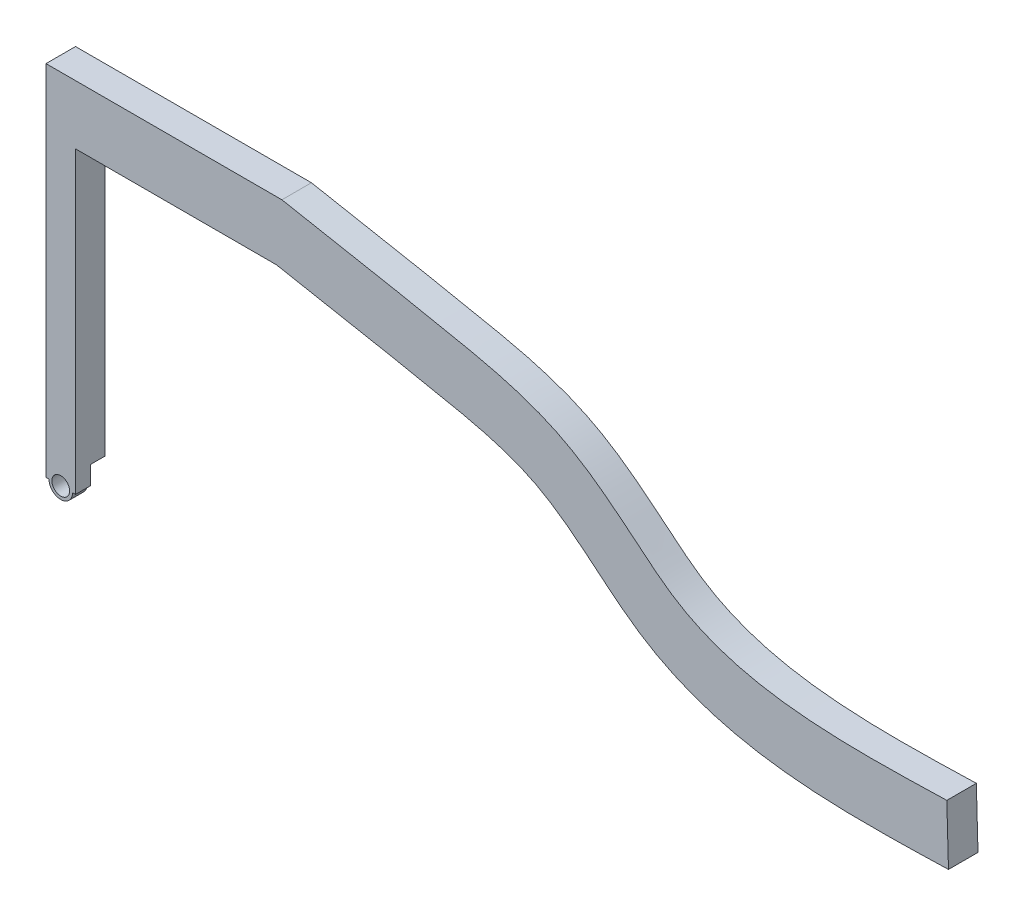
ISO-10303-21;
HEADER;
FILE_DESCRIPTION(('STEP AP214'),'2;1');
FILE_NAME('part.step','',(''),(''),'','','');
FILE_SCHEMA(('AUTOMOTIVE_DESIGN { 1 0 10303 214 1 1 1 1 }'));
ENDSEC;
DATA;
#1=APPLICATION_CONTEXT('core data for automotive mechanical design processes');
#2=APPLICATION_PROTOCOL_DEFINITION('international standard','automotive_design',2000,#1);
#3=PRODUCT_CONTEXT('',#1,'mechanical');
#4=PRODUCT('Part','Part','',(#3));
#5=PRODUCT_RELATED_PRODUCT_CATEGORY('part','',(#4));
#6=PRODUCT_DEFINITION_FORMATION('','',#4);
#7=PRODUCT_DEFINITION_CONTEXT('part definition',#1,'design');
#8=PRODUCT_DEFINITION('design','',#6,#7);
#9=PRODUCT_DEFINITION_SHAPE('','',#8);
#10=(LENGTH_UNIT() NAMED_UNIT(*) SI_UNIT(.MILLI.,.METRE.));
#11=(NAMED_UNIT(*) PLANE_ANGLE_UNIT() SI_UNIT($,.RADIAN.));
#12=(NAMED_UNIT(*) SI_UNIT($,.STERADIAN.) SOLID_ANGLE_UNIT());
#13=UNCERTAINTY_MEASURE_WITH_UNIT(LENGTH_MEASURE(1.E-05),#10,'distance_accuracy_value','');
#14=(GEOMETRIC_REPRESENTATION_CONTEXT(3) GLOBAL_UNCERTAINTY_ASSIGNED_CONTEXT((#13)) GLOBAL_UNIT_ASSIGNED_CONTEXT((#10,
#11,#12)) REPRESENTATION_CONTEXT('',''));
#15=CARTESIAN_POINT('',(0.,0.,0.));
#16=DIRECTION('',(0.,0.,1.));
#17=DIRECTION('',(1.,0.,0.));
#18=AXIS2_PLACEMENT_3D('',#15,#16,#17);
#19=CARTESIAN_POINT('',(0.,15.922114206,1.27));
#20=DIRECTION('',(0.,1.,0.));
#21=DIRECTION('',(0.,0.,1.));
#22=AXIS2_PLACEMENT_3D('',#19,#20,#21);
#23=PLANE('',#22);
#24=DIRECTION('',(1.,0.,0.));
#25=VECTOR('',#24,1.);
#26=CARTESIAN_POINT('',(0.,15.922114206,0.));
#27=LINE('',#26,#25);
#28=CARTESIAN_POINT('',(-1.27,15.922114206,0.));
#29=VERTEX_POINT('',#28);
#30=CARTESIAN_POINT('',(8.87717325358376,15.922114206,0.));
#31=VERTEX_POINT('',#30);
#32=EDGE_CURVE('E197',#29,#31,#27,.T.);
#33=ORIENTED_EDGE('',*,*,#32,.F.);
#34=DIRECTION('',(0.,0.,-1.));
#35=VECTOR('',#34,1.);
#36=CARTESIAN_POINT('',(-1.27,15.922114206,56.800017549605));
#37=LINE('',#36,#35);
#38=CARTESIAN_POINT('',(-1.27,15.922114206,1.27));
#39=VERTEX_POINT('',#38);
#40=EDGE_CURVE('E55',#39,#29,#37,.T.);
#41=ORIENTED_EDGE('',*,*,#40,.F.);
#42=DIRECTION('',(1.,0.,0.));
#43=VECTOR('',#42,1.);
#44=CARTESIAN_POINT('',(0.,15.922114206,1.27));
#45=LINE('',#44,#43);
#46=CARTESIAN_POINT('',(8.87717325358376,15.922114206,1.27));
#47=VERTEX_POINT('',#46);
#48=EDGE_CURVE('E144',#39,#47,#45,.T.);
#49=ORIENTED_EDGE('',*,*,#48,.T.);
#50=DIRECTION('',(0.,0.,-1.));
#51=VECTOR('',#50,1.);
#52=CARTESIAN_POINT('',(8.87717325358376,15.922114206,1.27));
#53=LINE('',#52,#51);
#54=EDGE_CURVE('E199',#47,#31,#53,.T.);
#55=ORIENTED_EDGE('',*,*,#54,.T.);
#56=EDGE_LOOP('',(#33,#41,#49,#55));
#57=FACE_BOUND('',#56,.T.);
#58=ADVANCED_FACE('F31',(#57),#23,.T.);
#59=CARTESIAN_POINT('',(22.8458258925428,8.55046759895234,1.27));
#60=DIRECTION('',(0.,0.,1.));
#61=DIRECTION('',(1.,0.,0.));
#62=AXIS2_PLACEMENT_3D('',#59,#60,#61);
#63=PLANE('',#62);
#64=DIRECTION('',(-1.,0.,0.));
#65=VECTOR('',#64,1.);
#66=CARTESIAN_POINT('',(22.8458258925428,0.508,1.27));
#67=LINE('',#66,#65);
#68=CARTESIAN_POINT('',(0.,0.508,1.27));
#69=VERTEX_POINT('',#68);
#70=CARTESIAN_POINT('',(-0.127,0.508,1.27));
#71=VERTEX_POINT('',#70);
#72=EDGE_CURVE('E234',#69,#71,#67,.T.);
#73=ORIENTED_EDGE('',*,*,#72,.F.);
#74=DIRECTION('',(0.,1.,0.));
#75=VECTOR('',#74,1.);
#76=CARTESIAN_POINT('',(0.,0.,1.27));
#77=LINE('',#76,#75);
#78=CARTESIAN_POINT('',(0.,13.382114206,1.27));
#79=VERTEX_POINT('',#78);
#80=EDGE_CURVE('E277',#69,#79,#77,.T.);
#81=ORIENTED_EDGE('',*,*,#80,.T.);
#82=DIRECTION('',(1.,0.,0.));
#83=VECTOR('',#82,1.);
#84=CARTESIAN_POINT('',(0.,13.382114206,1.27));
#85=LINE('',#84,#83);
#86=CARTESIAN_POINT('',(8.64245458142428,13.382114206,1.27));
#87=VERTEX_POINT('',#86);
#88=EDGE_CURVE('E281',#79,#87,#85,.T.);
#89=ORIENTED_EDGE('',*,*,#88,.T.);
#90=CARTESIAN_POINT('',(8.64245458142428,13.382114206,1.27));
#91=CARTESIAN_POINT('',(11.0061979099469,12.9414895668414,1.27));
#92=CARTESIAN_POINT('',(14.7474471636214,12.2440844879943,1.27));
#93=CARTESIAN_POINT('',(20.416060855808,11.0334460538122,1.27));
#94=CARTESIAN_POINT('',(25.9492012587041,4.98476305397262,1.27));
#95=CARTESIAN_POINT('',(32.7321140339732,5.17598260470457,1.27));
#96=CARTESIAN_POINT('',(37.5491794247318,5.31178223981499,1.27));
#97=B_SPLINE_CURVE_WITH_KNOTS('',3,(#90,#91,#92,#93,#94,#95,#96),.UNSPECIFIED.,.F.,.F.,(4,1,1,1,
4),(0.,0.238092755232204,0.376844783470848,0.557449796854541,1.),.UNSPECIFIED.);
#98=CARTESIAN_POINT('',(37.5491794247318,5.31178223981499,1.27));
#99=VERTEX_POINT('',#98);
#100=EDGE_CURVE('E153',#87,#99,#97,.T.);
#101=ORIENTED_EDGE('',*,*,#100,.T.);
#102=DIRECTION('',(0.0281801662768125,-0.999602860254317,0.));
#103=VECTOR('',#102,1.);
#104=CARTESIAN_POINT('',(37.4776018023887,7.85077350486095,1.27));
#105=LINE('',#104,#103);
#106=CARTESIAN_POINT('',(37.4776018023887,7.85077350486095,1.27));
#107=VERTEX_POINT('',#106);
#108=EDGE_CURVE('E158',#107,#99,#105,.T.);
#109=ORIENTED_EDGE('',*,*,#108,.F.);
#110=CARTESIAN_POINT('',(8.87717325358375,15.922114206,1.27));
#111=CARTESIAN_POINT('',(10.127765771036,15.688991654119,1.27));
#112=CARTESIAN_POINT('',(11.3811177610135,15.4556972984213,1.27));
#113=CARTESIAN_POINT('',(13.2751321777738,15.094458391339,1.27));
#114=CARTESIAN_POINT('',(13.908691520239,14.9721757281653,1.27));
#115=CARTESIAN_POINT('',(14.8633110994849,14.7845925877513,1.27));
#116=CARTESIAN_POINT('',(15.1822308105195,14.7213716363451,1.27));
#117=CARTESIAN_POINT('',(15.8216519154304,14.5933170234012,1.27));
#118=CARTESIAN_POINT('',(16.1393124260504,14.5291959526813,1.27));
#119=CARTESIAN_POINT('',(17.1154662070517,14.3289844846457,1.27));
#120=CARTESIAN_POINT('',(17.8101183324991,14.1814398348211,1.27));
#121=CARTESIAN_POINT('',(19.2540176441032,13.7757276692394,1.27));
#122=CARTESIAN_POINT('',(20.005232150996,13.5170448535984,1.27));
#123=CARTESIAN_POINT('',(20.9449044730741,13.054585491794,1.27));
#124=CARTESIAN_POINT('',(21.133502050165,12.9542845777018,1.27));
#125=CARTESIAN_POINT('',(21.4938993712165,12.7486894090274,1.27));
#126=CARTESIAN_POINT('',(21.6677320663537,12.6426406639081,1.27));
#127=CARTESIAN_POINT('',(22.1719274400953,12.3185733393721,1.27));
#128=CARTESIAN_POINT('',(22.4850266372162,12.0947729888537,1.27));
#129=CARTESIAN_POINT('',(23.3706428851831,11.4246469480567,1.27));
#130=CARTESIAN_POINT('',(23.8913226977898,10.9802351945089,1.27));
#131=CARTESIAN_POINT('',(24.6086347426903,10.3889140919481,1.27));
#132=CARTESIAN_POINT('',(24.8367149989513,10.2041619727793,1.27));
#133=CARTESIAN_POINT('',(25.2727394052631,9.86872197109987,1.27));
#134=CARTESIAN_POINT('',(25.4791146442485,9.71912794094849,1.27));
#135=CARTESIAN_POINT('',(26.0765547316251,9.32435327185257,1.27));
#136=CARTESIAN_POINT('',(26.4956744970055,9.09830830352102,1.27));
#137=CARTESIAN_POINT('',(27.8306626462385,8.51101149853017,1.27));
#138=CARTESIAN_POINT('',(28.8281438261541,8.24108343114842,1.27));
#139=CARTESIAN_POINT('',(31.0308635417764,7.89241946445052,1.27));
#140=CARTESIAN_POINT('',(32.2327444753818,7.81519546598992,1.27));
#141=CARTESIAN_POINT('',(34.7710257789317,7.77534974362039,1.27));
#142=CARTESIAN_POINT('',(36.1064621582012,7.81211921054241,1.27));
#143=CARTESIAN_POINT('',(37.4776018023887,7.85077350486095,1.27));
#144=B_SPLINE_CURVE_WITH_KNOTS('',3,(#110,#111,#112,#113,#114,#115,#116,#117,#118,#119,#120,
#121,#122,#123,#124,#125,#126,#127,#128,#129,#130,#131,#132,#133,#134,#135,#136,#137,#138,#139,
#140,#141,#142,#143),.UNSPECIFIED.,.F.,.F.,(4,2,2,2,2,2,2,2,2,2,2,2,2,2,2,2,4),(0.,
0.124999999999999,0.187499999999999,0.218749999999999,0.249999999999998,0.312499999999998,
0.374999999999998,0.390624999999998,0.406249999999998,0.437499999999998,0.499999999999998,
0.531249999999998,0.562499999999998,0.624999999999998,0.749999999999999,0.874999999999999,1.),.UNSPECIFIED.);
#145=EDGE_CURVE('E165',#47,#107,#144,.T.);
#146=ORIENTED_EDGE('',*,*,#145,.F.);
#147=ORIENTED_EDGE('',*,*,#48,.F.);
#148=DIRECTION('',(0.,-1.,0.));
#149=VECTOR('',#148,1.);
#150=CARTESIAN_POINT('',(-1.27,8.55046759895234,1.27));
#151=LINE('',#150,#149);
#152=CARTESIAN_POINT('',(-1.27,0.508,1.27));
#153=VERTEX_POINT('',#152);
#154=EDGE_CURVE('E135',#39,#153,#151,.T.);
#155=ORIENTED_EDGE('',*,*,#154,.T.);
#156=DIRECTION('',(-1.,0.,0.));
#157=VECTOR('',#156,1.);
#158=CARTESIAN_POINT('',(22.8458258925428,0.508,1.27));
#159=LINE('',#158,#157);
#160=CARTESIAN_POINT('',(-1.143,0.508,1.27));
#161=VERTEX_POINT('',#160);
#162=EDGE_CURVE('E121',#161,#153,#159,.T.);
#163=ORIENTED_EDGE('',*,*,#162,.F.);
#164=CARTESIAN_POINT('',(-0.635,0.508,1.27));
#165=DIRECTION('',(0.,0.,1.));
#166=DIRECTION('',(1.,0.,0.));
#167=AXIS2_PLACEMENT_3D('',#164,#165,#166);
#168=CIRCLE('',#167,0.508);
#169=EDGE_CURVE('E128',#71,#161,#168,.F.);
#170=ORIENTED_EDGE('',*,*,#169,.F.);
#171=EDGE_LOOP('',(#73,#81,#89,#101,#109,#146,#147,#155,#163,#170));
#172=FACE_BOUND('',#171,.T.);
#173=CARTESIAN_POINT('',(-0.635,0.508,1.27));
#174=DIRECTION('',(0.,0.,1.));
#175=DIRECTION('',(1.,0.,0.));
#176=AXIS2_PLACEMENT_3D('',#173,#174,#175);
#177=CIRCLE('',#176,0.381);
#178=CARTESIAN_POINT('',(-0.254,0.508,1.27));
#179=VERTEX_POINT('',#178);
#180=EDGE_CURVE('E150',#179,#179,#177,.T.);
#181=ORIENTED_EDGE('',*,*,#180,.F.);
#182=EDGE_LOOP('',(#181));
#183=FACE_BOUND('',#182,.T.);
#184=ADVANCED_FACE('F141',(#172,#183),#63,.T.);
#185=CARTESIAN_POINT('',(22.8458258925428,8.55046759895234,0.));
#186=DIRECTION('',(0.,0.,1.));
#187=DIRECTION('',(1.,0.,0.));
#188=AXIS2_PLACEMENT_3D('',#185,#186,#187);
#189=PLANE('',#188);
#190=DIRECTION('',(0.,1.,0.));
#191=VECTOR('',#190,1.);
#192=CARTESIAN_POINT('',(0.,0.,0.));
#193=LINE('',#192,#191);
#194=CARTESIAN_POINT('',(0.,1.3011147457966,0.));
#195=VERTEX_POINT('',#194);
#196=CARTESIAN_POINT('',(0.,13.382114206,0.));
#197=VERTEX_POINT('',#196);
#198=EDGE_CURVE('E203',#195,#197,#193,.T.);
#199=ORIENTED_EDGE('',*,*,#198,.F.);
#200=CARTESIAN_POINT('',(-0.635,0.508,0.));
#201=DIRECTION('',(0.,0.,-1.));
#202=DIRECTION('',(-1.,0.,0.));
#203=AXIS2_PLACEMENT_3D('',#200,#201,#202);
#204=CIRCLE('',#203,1.016);
#205=CARTESIAN_POINT('',(-1.27,1.3011147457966,0.));
#206=VERTEX_POINT('',#205);
#207=EDGE_CURVE('E241',#206,#195,#204,.T.);
#208=ORIENTED_EDGE('',*,*,#207,.F.);
#209=DIRECTION('',(0.,-1.,0.));
#210=VECTOR('',#209,1.);
#211=CARTESIAN_POINT('',(-1.27,8.55046759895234,0.));
#212=LINE('',#211,#210);
#213=EDGE_CURVE('E207',#29,#206,#212,.T.);
#214=ORIENTED_EDGE('',*,*,#213,.F.);
#215=ORIENTED_EDGE('',*,*,#32,.T.);
#216=CARTESIAN_POINT('',(8.87717325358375,15.922114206,0.));
#217=CARTESIAN_POINT('',(10.127765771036,15.688991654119,0.));
#218=CARTESIAN_POINT('',(11.3811177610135,15.4556972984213,0.));
#219=CARTESIAN_POINT('',(13.2751321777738,15.094458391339,0.));
#220=CARTESIAN_POINT('',(13.908691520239,14.9721757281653,0.));
#221=CARTESIAN_POINT('',(14.8633110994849,14.7845925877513,0.));
#222=CARTESIAN_POINT('',(15.1822308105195,14.7213716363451,0.));
#223=CARTESIAN_POINT('',(15.8216519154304,14.5933170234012,0.));
#224=CARTESIAN_POINT('',(16.1393124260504,14.5291959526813,0.));
#225=CARTESIAN_POINT('',(17.1154662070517,14.3289844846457,0.));
#226=CARTESIAN_POINT('',(17.8101183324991,14.1814398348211,0.));
#227=CARTESIAN_POINT('',(19.2540176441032,13.7757276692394,0.));
#228=CARTESIAN_POINT('',(20.005232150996,13.5170448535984,0.));
#229=CARTESIAN_POINT('',(20.9449044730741,13.054585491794,0.));
#230=CARTESIAN_POINT('',(21.133502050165,12.9542845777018,0.));
#231=CARTESIAN_POINT('',(21.4938993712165,12.7486894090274,0.));
#232=CARTESIAN_POINT('',(21.6677320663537,12.6426406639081,0.));
#233=CARTESIAN_POINT('',(22.1719274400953,12.3185733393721,0.));
#234=CARTESIAN_POINT('',(22.4850266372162,12.0947729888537,0.));
#235=CARTESIAN_POINT('',(23.3706428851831,11.4246469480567,0.));
#236=CARTESIAN_POINT('',(23.8913226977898,10.9802351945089,0.));
#237=CARTESIAN_POINT('',(24.6086347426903,10.3889140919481,0.));
#238=CARTESIAN_POINT('',(24.8367149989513,10.2041619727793,0.));
#239=CARTESIAN_POINT('',(25.2727394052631,9.86872197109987,0.));
#240=CARTESIAN_POINT('',(25.4791146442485,9.71912794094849,0.));
#241=CARTESIAN_POINT('',(26.0765547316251,9.32435327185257,0.));
#242=CARTESIAN_POINT('',(26.4956744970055,9.09830830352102,0.));
#243=CARTESIAN_POINT('',(27.8306626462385,8.51101149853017,0.));
#244=CARTESIAN_POINT('',(28.8281438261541,8.24108343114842,0.));
#245=CARTESIAN_POINT('',(31.0308635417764,7.89241946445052,0.));
#246=CARTESIAN_POINT('',(32.2327444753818,7.81519546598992,0.));
#247=CARTESIAN_POINT('',(34.7710257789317,7.77534974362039,0.));
#248=CARTESIAN_POINT('',(36.1064621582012,7.81211921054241,0.));
#249=CARTESIAN_POINT('',(37.4776018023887,7.85077350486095,0.));
#250=B_SPLINE_CURVE_WITH_KNOTS('',3,(#216,#217,#218,#219,#220,#221,#222,#223,#224,#225,#226,
#227,#228,#229,#230,#231,#232,#233,#234,#235,#236,#237,#238,#239,#240,#241,#242,#243,#244,#245,
#246,#247,#248,#249),.UNSPECIFIED.,.F.,.F.,(4,2,2,2,2,2,2,2,2,2,2,2,2,2,2,2,4),(0.,
0.124999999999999,0.187499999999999,0.218749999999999,0.249999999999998,0.312499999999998,
0.374999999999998,0.390624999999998,0.406249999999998,0.437499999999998,0.499999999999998,
0.531249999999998,0.562499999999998,0.624999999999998,0.749999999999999,0.874999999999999,1.),.UNSPECIFIED.);
#251=CARTESIAN_POINT('',(37.4776018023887,7.85077350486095,0.));
#252=VERTEX_POINT('',#251);
#253=EDGE_CURVE('E204',#31,#252,#250,.T.);
#254=ORIENTED_EDGE('',*,*,#253,.T.);
#255=DIRECTION('',(0.0281801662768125,-0.999602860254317,0.));
#256=VECTOR('',#255,1.);
#257=CARTESIAN_POINT('',(37.4776018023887,7.85077350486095,0.));
#258=LINE('',#257,#256);
#259=CARTESIAN_POINT('',(37.5491794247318,5.31178223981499,0.));
#260=VERTEX_POINT('',#259);
#261=EDGE_CURVE('E148',#252,#260,#258,.T.);
#262=ORIENTED_EDGE('',*,*,#261,.T.);
#263=CARTESIAN_POINT('',(8.64245458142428,13.382114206,0.));
#264=CARTESIAN_POINT('',(11.0061979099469,12.9414895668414,0.));
#265=CARTESIAN_POINT('',(14.7474471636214,12.2440844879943,0.));
#266=CARTESIAN_POINT('',(20.416060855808,11.0334460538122,0.));
#267=CARTESIAN_POINT('',(25.9492012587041,4.98476305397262,0.));
#268=CARTESIAN_POINT('',(32.7321140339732,5.17598260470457,0.));
#269=CARTESIAN_POINT('',(37.5491794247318,5.31178223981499,0.));
#270=B_SPLINE_CURVE_WITH_KNOTS('',3,(#263,#264,#265,#266,#267,#268,#269),.UNSPECIFIED.,.F.,.F.,
(4,1,1,1,4),(0.,0.238092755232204,0.376844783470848,0.557449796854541,1.),.UNSPECIFIED.);
#271=CARTESIAN_POINT('',(8.64245458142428,13.382114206,0.));
#272=VERTEX_POINT('',#271);
#273=EDGE_CURVE('E145',#272,#260,#270,.T.);
#274=ORIENTED_EDGE('',*,*,#273,.F.);
#275=DIRECTION('',(1.,0.,0.));
#276=VECTOR('',#275,1.);
#277=CARTESIAN_POINT('',(0.,13.382114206,0.));
#278=LINE('',#277,#276);
#279=EDGE_CURVE('E159',#197,#272,#278,.T.);
#280=ORIENTED_EDGE('',*,*,#279,.F.);
#281=EDGE_LOOP('',(#199,#208,#214,#215,#254,#262,#274,#280));
#282=FACE_BOUND('',#281,.T.);
#283=ADVANCED_FACE('F188',(#282),#189,.F.);
#284=DIRECTION('',(0.,0.,-1.));
#285=VECTOR('',#284,1.);
#286=SURFACE_OF_LINEAR_EXTRUSION('',#97,#285);
#287=ORIENTED_EDGE('',*,*,#273,.T.);
#288=DIRECTION('',(0.,0.,-1.));
#289=VECTOR('',#288,1.);
#290=CARTESIAN_POINT('',(37.5491794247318,5.31178223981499,1.27));
#291=LINE('',#290,#289);
#292=EDGE_CURVE('E210',#99,#260,#291,.T.);
#293=ORIENTED_EDGE('',*,*,#292,.F.);
#294=ORIENTED_EDGE('',*,*,#100,.F.);
#295=DIRECTION('',(0.,0.,-1.));
#296=VECTOR('',#295,1.);
#297=CARTESIAN_POINT('',(8.64245458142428,13.382114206,1.27));
#298=LINE('',#297,#296);
#299=EDGE_CURVE('E282',#87,#272,#298,.T.);
#300=ORIENTED_EDGE('',*,*,#299,.T.);
#301=EDGE_LOOP('',(#287,#293,#294,#300));
#302=FACE_BOUND('',#301,.T.);
#303=ADVANCED_FACE('F33',(#302),#286,.F.);
#304=CARTESIAN_POINT('',(37.4776018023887,7.85077350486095,1.27));
#305=DIRECTION('',(0.999602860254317,0.0281801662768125,0.));
#306=DIRECTION('',(-0.0281801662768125,0.999602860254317,0.));
#307=AXIS2_PLACEMENT_3D('',#304,#305,#306);
#308=PLANE('',#307);
#309=ORIENTED_EDGE('',*,*,#261,.F.);
#310=DIRECTION('',(0.,0.,-1.));
#311=VECTOR('',#310,1.);
#312=CARTESIAN_POINT('',(37.4776018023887,7.85077350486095,1.27));
#313=LINE('',#312,#311);
#314=EDGE_CURVE('E214',#107,#252,#313,.T.);
#315=ORIENTED_EDGE('',*,*,#314,.F.);
#316=ORIENTED_EDGE('',*,*,#108,.T.);
#317=ORIENTED_EDGE('',*,*,#292,.T.);
#318=EDGE_LOOP('',(#309,#315,#316,#317));
#319=FACE_BOUND('',#318,.T.);
#320=ADVANCED_FACE('F180',(#319),#308,.T.);
#321=DIRECTION('',(0.,0.,-1.));
#322=VECTOR('',#321,1.);
#323=SURFACE_OF_LINEAR_EXTRUSION('',#144,#322);
#324=ORIENTED_EDGE('',*,*,#253,.F.);
#325=ORIENTED_EDGE('',*,*,#54,.F.);
#326=ORIENTED_EDGE('',*,*,#145,.T.);
#327=ORIENTED_EDGE('',*,*,#314,.T.);
#328=EDGE_LOOP('',(#324,#325,#326,#327));
#329=FACE_BOUND('',#328,.T.);
#330=ADVANCED_FACE('F176',(#329),#323,.T.);
#331=CARTESIAN_POINT('',(0.,0.,1.27));
#332=DIRECTION('',(-1.,0.,0.));
#333=DIRECTION('',(0.,0.,1.));
#334=AXIS2_PLACEMENT_3D('',#331,#332,#333);
#335=PLANE('',#334);
#336=ORIENTED_EDGE('',*,*,#80,.F.);
#337=DIRECTION('',(0.,0.,1.));
#338=VECTOR('',#337,1.);
#339=CARTESIAN_POINT('',(0.,0.508,-52.6298032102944));
#340=LINE('',#339,#338);
#341=CARTESIAN_POINT('',(0.,0.508,0.634999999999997));
#342=VERTEX_POINT('',#341);
#343=EDGE_CURVE('E129',#342,#69,#340,.T.);
#344=ORIENTED_EDGE('',*,*,#343,.F.);
#345=DIRECTION('',(0.,1.,0.));
#346=VECTOR('',#345,1.);
#347=CARTESIAN_POINT('',(0.,0.,0.635));
#348=LINE('',#347,#346);
#349=CARTESIAN_POINT('',(0.,1.3011147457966,0.635));
#350=VERTEX_POINT('',#349);
#351=EDGE_CURVE('E220',#342,#350,#348,.T.);
#352=ORIENTED_EDGE('',*,*,#351,.T.);
#353=DIRECTION('',(0.,0.,-1.));
#354=VECTOR('',#353,1.);
#355=CARTESIAN_POINT('',(0.,1.3011147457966,3.50868195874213));
#356=LINE('',#355,#354);
#357=EDGE_CURVE('E246',#350,#195,#356,.T.);
#358=ORIENTED_EDGE('',*,*,#357,.T.);
#359=ORIENTED_EDGE('',*,*,#198,.T.);
#360=DIRECTION('',(0.,0.,-1.));
#361=VECTOR('',#360,1.);
#362=CARTESIAN_POINT('',(0.,13.382114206,1.27));
#363=LINE('',#362,#361);
#364=EDGE_CURVE('E279',#79,#197,#363,.T.);
#365=ORIENTED_EDGE('',*,*,#364,.F.);
#366=EDGE_LOOP('',(#336,#344,#352,#358,#359,#365));
#367=FACE_BOUND('',#366,.T.);
#368=ADVANCED_FACE('F179',(#367),#335,.F.);
#369=CARTESIAN_POINT('',(0.,13.382114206,1.27));
#370=DIRECTION('',(0.,1.,0.));
#371=DIRECTION('',(0.,0.,1.));
#372=AXIS2_PLACEMENT_3D('',#369,#370,#371);
#373=PLANE('',#372);
#374=ORIENTED_EDGE('',*,*,#279,.T.);
#375=ORIENTED_EDGE('',*,*,#299,.F.);
#376=ORIENTED_EDGE('',*,*,#88,.F.);
#377=ORIENTED_EDGE('',*,*,#364,.T.);
#378=EDGE_LOOP('',(#374,#375,#376,#377));
#379=FACE_BOUND('',#378,.T.);
#380=ADVANCED_FACE('F263',(#379),#373,.F.);
#381=CARTESIAN_POINT('',(-1.27,0.,56.800017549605));
#382=DIRECTION('',(-1.,0.,0.));
#383=DIRECTION('',(0.,0.,1.));
#384=AXIS2_PLACEMENT_3D('',#381,#382,#383);
#385=PLANE('',#384);
#386=DIRECTION('',(0.,0.,1.));
#387=VECTOR('',#386,1.);
#388=CARTESIAN_POINT('',(-1.27,0.508,-52.6298032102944));
#389=LINE('',#388,#387);
#390=CARTESIAN_POINT('',(-1.27,0.508,0.634999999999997));
#391=VERTEX_POINT('',#390);
#392=EDGE_CURVE('E47',#391,#153,#389,.T.);
#393=ORIENTED_EDGE('',*,*,#392,.T.);
#394=ORIENTED_EDGE('',*,*,#154,.F.);
#395=ORIENTED_EDGE('',*,*,#40,.T.);
#396=ORIENTED_EDGE('',*,*,#213,.T.);
#397=DIRECTION('',(0.,0.,-1.));
#398=VECTOR('',#397,1.);
#399=CARTESIAN_POINT('',(-1.27,1.3011147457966,3.50868195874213));
#400=LINE('',#399,#398);
#401=CARTESIAN_POINT('',(-1.27,1.3011147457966,0.635));
#402=VERTEX_POINT('',#401);
#403=EDGE_CURVE('E208',#402,#206,#400,.T.);
#404=ORIENTED_EDGE('',*,*,#403,.F.);
#405=DIRECTION('',(0.,1.,0.));
#406=VECTOR('',#405,1.);
#407=CARTESIAN_POINT('',(-1.27,0.,0.634999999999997));
#408=LINE('',#407,#406);
#409=EDGE_CURVE('E137',#391,#402,#408,.T.);
#410=ORIENTED_EDGE('',*,*,#409,.F.);
#411=EDGE_LOOP('',(#393,#394,#395,#396,#404,#410));
#412=FACE_BOUND('',#411,.T.);
#413=ADVANCED_FACE('F134',(#412),#385,.T.);
#414=CARTESIAN_POINT('',(-0.635,0.508,0.));
#415=DIRECTION('',(0.,0.,1.));
#416=DIRECTION('',(1.,0.,0.));
#417=AXIS2_PLACEMENT_3D('',#414,#415,#416);
#418=CYLINDRICAL_SURFACE('',#417,0.381);
#419=CARTESIAN_POINT('',(-0.635,0.508,0.635));
#420=DIRECTION('',(0.,0.,1.));
#421=DIRECTION('',(1.,0.,0.));
#422=AXIS2_PLACEMENT_3D('',#419,#420,#421);
#423=CIRCLE('',#422,0.381);
#424=CARTESIAN_POINT('',(-0.254,0.508,0.635));
#425=VERTEX_POINT('',#424);
#426=EDGE_CURVE('E218',#425,#425,#423,.F.);
#427=ORIENTED_EDGE('',*,*,#426,.T.);
#428=EDGE_LOOP('',(#427));
#429=FACE_BOUND('',#428,.T.);
#430=ORIENTED_EDGE('',*,*,#180,.T.);
#431=EDGE_LOOP('',(#430));
#432=FACE_BOUND('',#431,.T.);
#433=ADVANCED_FACE('F253',(#429,#432),#418,.F.);
#434=CARTESIAN_POINT('',(0.,0.,0.635));
#435=DIRECTION('',(0.,0.,1.));
#436=DIRECTION('',(1.,0.,0.));
#437=AXIS2_PLACEMENT_3D('',#434,#435,#436);
#438=PLANE('',#437);
#439=ORIENTED_EDGE('',*,*,#351,.F.);
#440=DIRECTION('',(-1.,0.,0.));
#441=VECTOR('',#440,1.);
#442=CARTESIAN_POINT('',(0.,0.508,0.635));
#443=LINE('',#442,#441);
#444=CARTESIAN_POINT('',(-0.127,0.508,0.634999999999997));
#445=VERTEX_POINT('',#444);
#446=EDGE_CURVE('E11',#342,#445,#443,.T.);
#447=ORIENTED_EDGE('',*,*,#446,.T.);
#448=CARTESIAN_POINT('',(-0.635,0.508,0.634999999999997));
#449=DIRECTION('',(0.,0.,1.));
#450=DIRECTION('',(1.,0.,0.));
#451=AXIS2_PLACEMENT_3D('',#448,#449,#450);
#452=CIRCLE('',#451,0.508);
#453=CARTESIAN_POINT('',(-1.143,0.508,0.634999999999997));
#454=VERTEX_POINT('',#453);
#455=EDGE_CURVE('E40',#445,#454,#452,.F.);
#456=ORIENTED_EDGE('',*,*,#455,.T.);
#457=DIRECTION('',(-1.,0.,0.));
#458=VECTOR('',#457,1.);
#459=CARTESIAN_POINT('',(0.,0.508,0.635));
#460=LINE('',#459,#458);
#461=EDGE_CURVE('E212',#454,#391,#460,.T.);
#462=ORIENTED_EDGE('',*,*,#461,.T.);
#463=ORIENTED_EDGE('',*,*,#409,.T.);
#464=CARTESIAN_POINT('',(-0.635,0.508,0.635));
#465=DIRECTION('',(0.,0.,1.));
#466=DIRECTION('',(1.,0.,0.));
#467=AXIS2_PLACEMENT_3D('',#464,#465,#466);
#468=CIRCLE('',#467,1.016);
#469=EDGE_CURVE('E243',#402,#350,#468,.F.);
#470=ORIENTED_EDGE('',*,*,#469,.T.);
#471=EDGE_LOOP('',(#439,#447,#456,#462,#463,#470));
#472=FACE_BOUND('',#471,.T.);
#473=ORIENTED_EDGE('',*,*,#426,.F.);
#474=EDGE_LOOP('',(#473));
#475=FACE_BOUND('',#474,.T.);
#476=ADVANCED_FACE('F225',(#472,#475),#438,.F.);
#477=CARTESIAN_POINT('',(-0.635,0.508,3.50868195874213));
#478=DIRECTION('',(0.,0.,-1.));
#479=DIRECTION('',(-1.,0.,0.));
#480=AXIS2_PLACEMENT_3D('',#477,#478,#479);
#481=CYLINDRICAL_SURFACE('',#480,1.016);
#482=ORIENTED_EDGE('',*,*,#469,.F.);
#483=ORIENTED_EDGE('',*,*,#403,.T.);
#484=ORIENTED_EDGE('',*,*,#207,.T.);
#485=ORIENTED_EDGE('',*,*,#357,.F.);
#486=EDGE_LOOP('',(#482,#483,#484,#485));
#487=FACE_BOUND('',#486,.T.);
#488=ADVANCED_FACE('F261',(#487),#481,.F.);
#489=CARTESIAN_POINT('',(-0.127,0.508,-52.6298032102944));
#490=DIRECTION('',(0.,1.,0.));
#491=DIRECTION('',(0.,0.,1.));
#492=AXIS2_PLACEMENT_3D('',#489,#490,#491);
#493=PLANE('',#492);
#494=ORIENTED_EDGE('',*,*,#343,.T.);
#495=ORIENTED_EDGE('',*,*,#72,.T.);
#496=DIRECTION('',(0.,0.,1.));
#497=VECTOR('',#496,1.);
#498=CARTESIAN_POINT('',(-0.127,0.508,-52.6298032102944));
#499=LINE('',#498,#497);
#500=EDGE_CURVE('E138',#445,#71,#499,.T.);
#501=ORIENTED_EDGE('',*,*,#500,.F.);
#502=ORIENTED_EDGE('',*,*,#446,.F.);
#503=EDGE_LOOP('',(#494,#495,#501,#502));
#504=FACE_BOUND('',#503,.T.);
#505=ADVANCED_FACE('F232',(#504),#493,.F.);
#506=CARTESIAN_POINT('',(-0.635,0.508,-52.6298032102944));
#507=DIRECTION('',(0.,0.,1.));
#508=DIRECTION('',(1.,0.,0.));
#509=AXIS2_PLACEMENT_3D('',#506,#507,#508);
#510=CYLINDRICAL_SURFACE('',#509,0.508);
#511=ORIENTED_EDGE('',*,*,#500,.T.);
#512=ORIENTED_EDGE('',*,*,#169,.T.);
#513=DIRECTION('',(0.,0.,1.));
#514=VECTOR('',#513,1.);
#515=CARTESIAN_POINT('',(-1.143,0.508,-52.6298032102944));
#516=LINE('',#515,#514);
#517=EDGE_CURVE('E124',#454,#161,#516,.T.);
#518=ORIENTED_EDGE('',*,*,#517,.F.);
#519=ORIENTED_EDGE('',*,*,#455,.F.);
#520=EDGE_LOOP('',(#511,#512,#518,#519));
#521=FACE_BOUND('',#520,.T.);
#522=ADVANCED_FACE('F230',(#521),#510,.T.);
#523=CARTESIAN_POINT('',(-1.143,0.508,-52.6298032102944));
#524=DIRECTION('',(0.,1.,0.));
#525=DIRECTION('',(0.,0.,1.));
#526=AXIS2_PLACEMENT_3D('',#523,#524,#525);
#527=PLANE('',#526);
#528=ORIENTED_EDGE('',*,*,#517,.T.);
#529=ORIENTED_EDGE('',*,*,#162,.T.);
#530=ORIENTED_EDGE('',*,*,#392,.F.);
#531=ORIENTED_EDGE('',*,*,#461,.F.);
#532=EDGE_LOOP('',(#528,#529,#530,#531));
#533=FACE_BOUND('',#532,.T.);
#534=ADVANCED_FACE('F122',(#533),#527,.F.);
#535=CLOSED_SHELL('',(#58,#184,#283,#303,#320,#330,#368,#380,#413,#433,#476,#488,#505,#522,#534));
#536=MANIFOLD_SOLID_BREP('B2',#535);
#537=ADVANCED_BREP_SHAPE_REPRESENTATION('',(#18,#536),#14);
#538=SHAPE_DEFINITION_REPRESENTATION(#9,#537);
ENDSEC;
END-ISO-10303-21;
